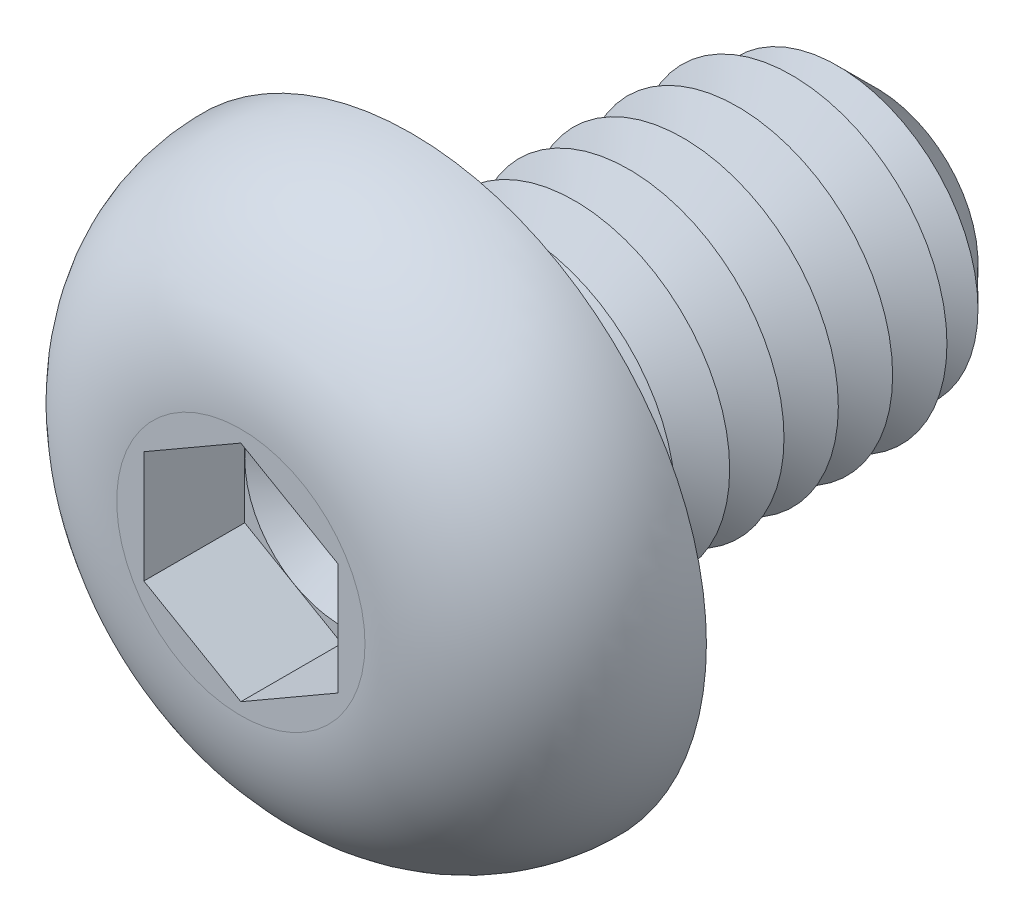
ISO-10303-21;
HEADER;
FILE_DESCRIPTION(('STEP AP214'),'2;1');
FILE_NAME('part.step','',(''),(''),'','','');
FILE_SCHEMA(('AUTOMOTIVE_DESIGN { 1 0 10303 214 1 1 1 1 }'));
ENDSEC;
DATA;
#1=APPLICATION_CONTEXT('core data for automotive mechanical design processes');
#2=APPLICATION_PROTOCOL_DEFINITION('international standard','automotive_design',2000,#1);
#3=PRODUCT_CONTEXT('',#1,'mechanical');
#4=PRODUCT('Part','Part','',(#3));
#5=PRODUCT_RELATED_PRODUCT_CATEGORY('part','',(#4));
#6=PRODUCT_DEFINITION_FORMATION('','',#4);
#7=PRODUCT_DEFINITION_CONTEXT('part definition',#1,'design');
#8=PRODUCT_DEFINITION('design','',#6,#7);
#9=PRODUCT_DEFINITION_SHAPE('','',#8);
#10=(LENGTH_UNIT() NAMED_UNIT(*) SI_UNIT(.MILLI.,.METRE.));
#11=(NAMED_UNIT(*) PLANE_ANGLE_UNIT() SI_UNIT($,.RADIAN.));
#12=(NAMED_UNIT(*) SI_UNIT($,.STERADIAN.) SOLID_ANGLE_UNIT());
#13=UNCERTAINTY_MEASURE_WITH_UNIT(LENGTH_MEASURE(1.E-05),#10,'distance_accuracy_value','');
#14=(GEOMETRIC_REPRESENTATION_CONTEXT(3) GLOBAL_UNCERTAINTY_ASSIGNED_CONTEXT((#13)) GLOBAL_UNIT_ASSIGNED_CONTEXT((#10,
#11,#12)) REPRESENTATION_CONTEXT('',''));
#15=CARTESIAN_POINT('',(0.,0.,0.));
#16=DIRECTION('',(0.,0.,1.));
#17=DIRECTION('',(1.,0.,0.));
#18=AXIS2_PLACEMENT_3D('',#15,#16,#17);
#19=CARTESIAN_POINT('',(0.,0.,0.900000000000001));
#20=DIRECTION('',(0.,0.,1.));
#21=DIRECTION('',(1.,0.,0.));
#22=AXIS2_PLACEMENT_3D('',#19,#20,#21);
#23=PLANE('',#22);
#24=CARTESIAN_POINT('',(0.,0.,0.900000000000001));
#25=DIRECTION('',(0.,0.,1.));
#26=DIRECTION('',(1.,0.,0.));
#27=AXIS2_PLACEMENT_3D('',#24,#25,#26);
#28=CIRCLE('',#27,1.25);
#29=CARTESIAN_POINT('',(1.25,0.,0.900000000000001));
#30=VERTEX_POINT('',#29);
#31=CARTESIAN_POINT('',(0.625,1.08253175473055,0.900000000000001));
#32=VERTEX_POINT('',#31);
#33=EDGE_CURVE('E117',#30,#32,#28,.T.);
#34=ORIENTED_EDGE('',*,*,#33,.F.);
#35=DIRECTION('',(0.,1.,0.));
#36=VECTOR('',#35,1.);
#37=CARTESIAN_POINT('',(1.25,-0.721687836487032,0.900000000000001));
#38=LINE('',#37,#36);
#39=CARTESIAN_POINT('',(1.25,0.721687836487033,0.900000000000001));
#40=VERTEX_POINT('',#39);
#41=EDGE_CURVE('E140',#30,#40,#38,.T.);
#42=ORIENTED_EDGE('',*,*,#41,.T.);
#43=DIRECTION('',(-0.866025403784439,0.5,0.));
#44=VECTOR('',#43,1.);
#45=CARTESIAN_POINT('',(1.25,0.721687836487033,0.900000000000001));
#46=LINE('',#45,#44);
#47=EDGE_CURVE('E135',#40,#32,#46,.T.);
#48=ORIENTED_EDGE('',*,*,#47,.T.);
#49=EDGE_LOOP('',(#34,#42,#48));
#50=FACE_BOUND('',#49,.T.);
#51=ADVANCED_FACE('F39',(#50),#23,.T.);
#52=CARTESIAN_POINT('',(0.,0.,0.900000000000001));
#53=DIRECTION('',(0.,0.,1.));
#54=DIRECTION('',(1.,0.,0.));
#55=AXIS2_PLACEMENT_3D('',#52,#53,#54);
#56=CIRCLE('',#55,1.25);
#57=CARTESIAN_POINT('',(-0.625,1.08253175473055,0.900000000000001));
#58=VERTEX_POINT('',#57);
#59=EDGE_CURVE('E11',#32,#58,#56,.T.);
#60=ORIENTED_EDGE('',*,*,#59,.F.);
#61=CARTESIAN_POINT('',(0.,1.44337567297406,0.900000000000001));
#62=VERTEX_POINT('',#61);
#63=EDGE_CURVE('E130',#32,#62,#46,.T.);
#64=ORIENTED_EDGE('',*,*,#63,.T.);
#65=DIRECTION('',(-0.866025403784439,-0.5,0.));
#66=VECTOR('',#65,1.);
#67=CARTESIAN_POINT('',(0.,1.44337567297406,0.900000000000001));
#68=LINE('',#67,#66);
#69=EDGE_CURVE('E132',#62,#58,#68,.T.);
#70=ORIENTED_EDGE('',*,*,#69,.T.);
#71=EDGE_LOOP('',(#60,#64,#70));
#72=FACE_BOUND('',#71,.T.);
#73=ADVANCED_FACE('F129',(#72),#23,.T.);
#74=CARTESIAN_POINT('',(-1.25,0.,0.900000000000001));
#75=VERTEX_POINT('',#74);
#76=EDGE_CURVE('E49',#58,#75,#56,.T.);
#77=ORIENTED_EDGE('',*,*,#76,.F.);
#78=CARTESIAN_POINT('',(-1.25,0.721687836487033,0.900000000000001));
#79=VERTEX_POINT('',#78);
#80=EDGE_CURVE('E143',#58,#79,#68,.T.);
#81=ORIENTED_EDGE('',*,*,#80,.T.);
#82=DIRECTION('',(0.,-1.,0.));
#83=VECTOR('',#82,1.);
#84=CARTESIAN_POINT('',(-1.25,0.721687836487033,0.900000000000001));
#85=LINE('',#84,#83);
#86=EDGE_CURVE('E153',#79,#75,#85,.T.);
#87=ORIENTED_EDGE('',*,*,#86,.T.);
#88=EDGE_LOOP('',(#77,#81,#87));
#89=FACE_BOUND('',#88,.T.);
#90=ADVANCED_FACE('F253',(#89),#23,.T.);
#91=CARTESIAN_POINT('',(-0.625,-1.08253175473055,0.900000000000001));
#92=VERTEX_POINT('',#91);
#93=EDGE_CURVE('E237',#75,#92,#56,.T.);
#94=ORIENTED_EDGE('',*,*,#93,.F.);
#95=CARTESIAN_POINT('',(-1.25,-0.721687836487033,0.900000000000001));
#96=VERTEX_POINT('',#95);
#97=EDGE_CURVE('E152',#75,#96,#85,.T.);
#98=ORIENTED_EDGE('',*,*,#97,.T.);
#99=DIRECTION('',(0.866025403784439,-0.5,0.));
#100=VECTOR('',#99,1.);
#101=CARTESIAN_POINT('',(-1.25,-0.721687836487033,0.900000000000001));
#102=LINE('',#101,#100);
#103=EDGE_CURVE('E158',#96,#92,#102,.T.);
#104=ORIENTED_EDGE('',*,*,#103,.T.);
#105=EDGE_LOOP('',(#94,#98,#104));
#106=FACE_BOUND('',#105,.T.);
#107=ADVANCED_FACE('F247',(#106),#23,.T.);
#108=CARTESIAN_POINT('',(0.625,-1.08253175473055,0.900000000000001));
#109=VERTEX_POINT('',#108);
#110=EDGE_CURVE('E56',#92,#109,#56,.T.);
#111=ORIENTED_EDGE('',*,*,#110,.F.);
#112=CARTESIAN_POINT('',(0.,-1.44337567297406,0.900000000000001));
#113=VERTEX_POINT('',#112);
#114=EDGE_CURVE('E157',#92,#113,#102,.T.);
#115=ORIENTED_EDGE('',*,*,#114,.T.);
#116=DIRECTION('',(0.866025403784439,0.5,0.));
#117=VECTOR('',#116,1.);
#118=CARTESIAN_POINT('',(0.,-1.44337567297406,0.900000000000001));
#119=LINE('',#118,#117);
#120=EDGE_CURVE('E163',#113,#109,#119,.T.);
#121=ORIENTED_EDGE('',*,*,#120,.T.);
#122=EDGE_LOOP('',(#111,#115,#121));
#123=FACE_BOUND('',#122,.T.);
#124=ADVANCED_FACE('F352',(#123),#23,.T.);
#125=CARTESIAN_POINT('',(0.,0.,-6.));
#126=DIRECTION('',(0.,0.,1.));
#127=DIRECTION('',(1.,0.,0.));
#128=AXIS2_PLACEMENT_3D('',#125,#126,#127);
#129=CYLINDRICAL_SURFACE('',#128,2.);
#130=CARTESIAN_POINT('',(0.,0.,-0.3));
#131=DIRECTION('',(0.,0.,1.));
#132=DIRECTION('',(1.,0.,0.));
#133=AXIS2_PLACEMENT_3D('',#130,#131,#132);
#134=CIRCLE('',#133,2.);
#135=CARTESIAN_POINT('',(2.,0.,-0.3));
#136=VERTEX_POINT('',#135);
#137=EDGE_CURVE('E220',#136,#136,#134,.F.);
#138=ORIENTED_EDGE('',*,*,#137,.T.);
#139=EDGE_LOOP('',(#138));
#140=FACE_BOUND('',#139,.T.);
#141=CARTESIAN_POINT('',(0.,0.,-0.699999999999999));
#142=DIRECTION('',(0.,0.,1.));
#143=DIRECTION('',(1.,0.,0.));
#144=AXIS2_PLACEMENT_3D('',#141,#142,#143);
#145=CIRCLE('',#144,2.);
#146=CARTESIAN_POINT('',(2.,0.,-0.699999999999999));
#147=VERTEX_POINT('',#146);
#148=EDGE_CURVE('E148',#147,#147,#145,.T.);
#149=ORIENTED_EDGE('',*,*,#148,.T.);
#150=EDGE_LOOP('',(#149));
#151=FACE_BOUND('',#150,.T.);
#152=ADVANCED_FACE('F362',(#140,#151),#129,.T.);
#153=CARTESIAN_POINT('',(0.,3.8,0.));
#154=DIRECTION('',(0.,0.,1.));
#155=DIRECTION('',(1.,0.,0.));
#156=AXIS2_PLACEMENT_3D('',#153,#154,#155);
#157=PLANE('',#156);
#158=CARTESIAN_POINT('',(0.,0.,0.));
#159=DIRECTION('',(0.,0.,1.));
#160=DIRECTION('',(1.,0.,0.));
#161=AXIS2_PLACEMENT_3D('',#158,#159,#160);
#162=CIRCLE('',#161,2.3);
#163=CARTESIAN_POINT('',(2.3,0.,0.));
#164=VERTEX_POINT('',#163);
#165=EDGE_CURVE('E229',#164,#164,#162,.T.);
#166=ORIENTED_EDGE('',*,*,#165,.T.);
#167=EDGE_LOOP('',(#166));
#168=FACE_BOUND('',#167,.T.);
#169=CARTESIAN_POINT('',(0.,0.,0.));
#170=DIRECTION('',(0.,0.,1.));
#171=DIRECTION('',(1.,0.,0.));
#172=AXIS2_PLACEMENT_3D('',#169,#170,#171);
#173=CIRCLE('',#172,3.8);
#174=CARTESIAN_POINT('',(3.8,0.,0.));
#175=VERTEX_POINT('',#174);
#176=EDGE_CURVE('E195',#175,#175,#173,.T.);
#177=ORIENTED_EDGE('',*,*,#176,.F.);
#178=EDGE_LOOP('',(#177));
#179=FACE_BOUND('',#178,.T.);
#180=ADVANCED_FACE('F367',(#168,#179),#157,.F.);
#181=CARTESIAN_POINT('',(0.,0.,2.2));
#182=DIRECTION('',(0.,0.,-1.));
#183=DIRECTION('',(-1.,0.,0.));
#184=AXIS2_PLACEMENT_3D('',#181,#182,#183);
#185=PLANE('',#184);
#186=DIRECTION('',(-0.866025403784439,-0.5,0.));
#187=VECTOR('',#186,1.);
#188=CARTESIAN_POINT('',(0.,1.44337567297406,2.2));
#189=LINE('',#188,#187);
#190=CARTESIAN_POINT('',(0.,1.44337567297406,2.2));
#191=VERTEX_POINT('',#190);
#192=CARTESIAN_POINT('',(-1.25,0.721687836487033,2.2));
#193=VERTEX_POINT('',#192);
#194=EDGE_CURVE('E173',#191,#193,#189,.T.);
#195=ORIENTED_EDGE('',*,*,#194,.F.);
#196=DIRECTION('',(-0.866025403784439,0.5,0.));
#197=VECTOR('',#196,1.);
#198=CARTESIAN_POINT('',(1.25,0.721687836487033,2.2));
#199=LINE('',#198,#197);
#200=CARTESIAN_POINT('',(1.25,0.721687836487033,2.2));
#201=VERTEX_POINT('',#200);
#202=EDGE_CURVE('E64',#201,#191,#199,.T.);
#203=ORIENTED_EDGE('',*,*,#202,.F.);
#204=DIRECTION('',(0.,1.,0.));
#205=VECTOR('',#204,1.);
#206=CARTESIAN_POINT('',(1.25,-0.721687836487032,2.2));
#207=LINE('',#206,#205);
#208=CARTESIAN_POINT('',(1.25,-0.721687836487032,2.2));
#209=VERTEX_POINT('',#208);
#210=EDGE_CURVE('E138',#209,#201,#207,.T.);
#211=ORIENTED_EDGE('',*,*,#210,.F.);
#212=DIRECTION('',(0.866025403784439,0.5,0.));
#213=VECTOR('',#212,1.);
#214=CARTESIAN_POINT('',(0.,-1.44337567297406,2.2));
#215=LINE('',#214,#213);
#216=CARTESIAN_POINT('',(0.,-1.44337567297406,2.2));
#217=VERTEX_POINT('',#216);
#218=EDGE_CURVE('E185',#217,#209,#215,.T.);
#219=ORIENTED_EDGE('',*,*,#218,.F.);
#220=DIRECTION('',(0.866025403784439,-0.5,0.));
#221=VECTOR('',#220,1.);
#222=CARTESIAN_POINT('',(-1.25,-0.721687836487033,2.2));
#223=LINE('',#222,#221);
#224=CARTESIAN_POINT('',(-1.25,-0.721687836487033,2.2));
#225=VERTEX_POINT('',#224);
#226=EDGE_CURVE('E181',#225,#217,#223,.T.);
#227=ORIENTED_EDGE('',*,*,#226,.F.);
#228=DIRECTION('',(0.,-1.,0.));
#229=VECTOR('',#228,1.);
#230=CARTESIAN_POINT('',(-1.25,0.721687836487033,2.2));
#231=LINE('',#230,#229);
#232=EDGE_CURVE('E177',#193,#225,#231,.T.);
#233=ORIENTED_EDGE('',*,*,#232,.F.);
#234=EDGE_LOOP('',(#195,#203,#211,#219,#227,#233));
#235=FACE_BOUND('',#234,.T.);
#236=CARTESIAN_POINT('',(0.,0.,2.2));
#237=DIRECTION('',(0.,0.,1.));
#238=DIRECTION('',(1.,0.,0.));
#239=AXIS2_PLACEMENT_3D('',#236,#237,#238);
#240=CIRCLE('',#239,1.6);
#241=CARTESIAN_POINT('',(1.6,0.,2.2));
#242=VERTEX_POINT('',#241);
#243=EDGE_CURVE('E212',#242,#242,#240,.T.);
#244=ORIENTED_EDGE('',*,*,#243,.T.);
#245=EDGE_LOOP('',(#244));
#246=FACE_BOUND('',#245,.T.);
#247=ADVANCED_FACE('F262',(#235,#246),#185,.F.);
#248=CARTESIAN_POINT('',(0.,0.,0.));
#249=DIRECTION('',(0.,0.,1.));
#250=DIRECTION('',(1.,0.,0.));
#251=AXIS2_PLACEMENT_3D('',#248,#249,#250);
#252=DEGENERATE_TOROIDAL_SURFACE('',#251,1.6,2.2,.T.);
#253=ORIENTED_EDGE('',*,*,#243,.F.);
#254=EDGE_LOOP('',(#253));
#255=FACE_BOUND('',#254,.T.);
#256=ORIENTED_EDGE('',*,*,#176,.T.);
#257=EDGE_LOOP('',(#256));
#258=FACE_BOUND('',#257,.T.);
#259=ADVANCED_FACE('F388',(#255,#258),#252,.T.);
#260=CARTESIAN_POINT('',(1.25,0.721687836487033,0.900000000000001));
#261=DIRECTION('',(0.5,0.866025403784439,0.));
#262=DIRECTION('',(-0.866025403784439,0.5,0.));
#263=AXIS2_PLACEMENT_3D('',#260,#261,#262);
#264=PLANE('',#263);
#265=ORIENTED_EDGE('',*,*,#202,.T.);
#266=DIRECTION('',(0.,0.,1.));
#267=VECTOR('',#266,1.);
#268=CARTESIAN_POINT('',(0.,1.44337567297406,0.900000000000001));
#269=LINE('',#268,#267);
#270=EDGE_CURVE('E136',#62,#191,#269,.T.);
#271=ORIENTED_EDGE('',*,*,#270,.F.);
#272=ORIENTED_EDGE('',*,*,#63,.F.);
#273=ORIENTED_EDGE('',*,*,#47,.F.);
#274=DIRECTION('',(0.,0.,1.));
#275=VECTOR('',#274,1.);
#276=CARTESIAN_POINT('',(1.25,0.721687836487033,0.900000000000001));
#277=LINE('',#276,#275);
#278=EDGE_CURVE('E192',#40,#201,#277,.T.);
#279=ORIENTED_EDGE('',*,*,#278,.T.);
#280=EDGE_LOOP('',(#265,#271,#272,#273,#279));
#281=FACE_BOUND('',#280,.T.);
#282=ADVANCED_FACE('F134',(#281),#264,.F.);
#283=CARTESIAN_POINT('',(1.25,-0.721687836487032,0.900000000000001));
#284=DIRECTION('',(1.,0.,0.));
#285=DIRECTION('',(0.,1.,0.));
#286=AXIS2_PLACEMENT_3D('',#283,#284,#285);
#287=PLANE('',#286);
#288=ORIENTED_EDGE('',*,*,#210,.T.);
#289=ORIENTED_EDGE('',*,*,#278,.F.);
#290=ORIENTED_EDGE('',*,*,#41,.F.);
#291=CARTESIAN_POINT('',(1.25,-0.721687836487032,0.900000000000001));
#292=VERTEX_POINT('',#291);
#293=EDGE_CURVE('E167',#292,#30,#38,.T.);
#294=ORIENTED_EDGE('',*,*,#293,.F.);
#295=DIRECTION('',(0.,0.,1.));
#296=VECTOR('',#295,1.);
#297=CARTESIAN_POINT('',(1.25,-0.721687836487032,0.900000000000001));
#298=LINE('',#297,#296);
#299=EDGE_CURVE('E196',#292,#209,#298,.T.);
#300=ORIENTED_EDGE('',*,*,#299,.T.);
#301=EDGE_LOOP('',(#288,#289,#290,#294,#300));
#302=FACE_BOUND('',#301,.T.);
#303=ADVANCED_FACE('F381',(#302),#287,.F.);
#304=CARTESIAN_POINT('',(0.,-1.44337567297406,0.900000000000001));
#305=DIRECTION('',(0.5,-0.866025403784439,0.));
#306=DIRECTION('',(0.866025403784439,0.5,0.));
#307=AXIS2_PLACEMENT_3D('',#304,#305,#306);
#308=PLANE('',#307);
#309=ORIENTED_EDGE('',*,*,#218,.T.);
#310=ORIENTED_EDGE('',*,*,#299,.F.);
#311=EDGE_CURVE('E162',#109,#292,#119,.T.);
#312=ORIENTED_EDGE('',*,*,#311,.F.);
#313=ORIENTED_EDGE('',*,*,#120,.F.);
#314=DIRECTION('',(0.,0.,1.));
#315=VECTOR('',#314,1.);
#316=CARTESIAN_POINT('',(0.,-1.44337567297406,0.900000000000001));
#317=LINE('',#316,#315);
#318=EDGE_CURVE('E198',#113,#217,#317,.T.);
#319=ORIENTED_EDGE('',*,*,#318,.T.);
#320=EDGE_LOOP('',(#309,#310,#312,#313,#319));
#321=FACE_BOUND('',#320,.T.);
#322=ADVANCED_FACE('F371',(#321),#308,.F.);
#323=CARTESIAN_POINT('',(-1.25,-0.721687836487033,0.900000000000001));
#324=DIRECTION('',(-0.5,-0.866025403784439,0.));
#325=DIRECTION('',(0.866025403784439,-0.5,0.));
#326=AXIS2_PLACEMENT_3D('',#323,#324,#325);
#327=PLANE('',#326);
#328=ORIENTED_EDGE('',*,*,#226,.T.);
#329=ORIENTED_EDGE('',*,*,#318,.F.);
#330=ORIENTED_EDGE('',*,*,#114,.F.);
#331=ORIENTED_EDGE('',*,*,#103,.F.);
#332=DIRECTION('',(0.,0.,1.));
#333=VECTOR('',#332,1.);
#334=CARTESIAN_POINT('',(-1.25,-0.721687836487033,0.900000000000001));
#335=LINE('',#334,#333);
#336=EDGE_CURVE('E201',#96,#225,#335,.T.);
#337=ORIENTED_EDGE('',*,*,#336,.T.);
#338=EDGE_LOOP('',(#328,#329,#330,#331,#337));
#339=FACE_BOUND('',#338,.T.);
#340=ADVANCED_FACE('F267',(#339),#327,.F.);
#341=CARTESIAN_POINT('',(-1.25,0.721687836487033,0.900000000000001));
#342=DIRECTION('',(-1.,0.,0.));
#343=DIRECTION('',(0.,0.,1.));
#344=AXIS2_PLACEMENT_3D('',#341,#342,#343);
#345=PLANE('',#344);
#346=ORIENTED_EDGE('',*,*,#232,.T.);
#347=ORIENTED_EDGE('',*,*,#336,.F.);
#348=ORIENTED_EDGE('',*,*,#97,.F.);
#349=ORIENTED_EDGE('',*,*,#86,.F.);
#350=DIRECTION('',(0.,0.,1.));
#351=VECTOR('',#350,1.);
#352=CARTESIAN_POINT('',(-1.25,0.721687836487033,0.900000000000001));
#353=LINE('',#352,#351);
#354=EDGE_CURVE('E204',#79,#193,#353,.T.);
#355=ORIENTED_EDGE('',*,*,#354,.T.);
#356=EDGE_LOOP('',(#346,#347,#348,#349,#355));
#357=FACE_BOUND('',#356,.T.);
#358=ADVANCED_FACE('F252',(#357),#345,.F.);
#359=CARTESIAN_POINT('',(0.,1.44337567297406,0.900000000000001));
#360=DIRECTION('',(-0.5,0.866025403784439,0.));
#361=DIRECTION('',(-0.866025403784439,-0.5,0.));
#362=AXIS2_PLACEMENT_3D('',#359,#360,#361);
#363=PLANE('',#362);
#364=ORIENTED_EDGE('',*,*,#194,.T.);
#365=ORIENTED_EDGE('',*,*,#354,.F.);
#366=ORIENTED_EDGE('',*,*,#80,.F.);
#367=ORIENTED_EDGE('',*,*,#69,.F.);
#368=ORIENTED_EDGE('',*,*,#270,.T.);
#369=EDGE_LOOP('',(#364,#365,#366,#367,#368));
#370=FACE_BOUND('',#369,.T.);
#371=ADVANCED_FACE('F256',(#370),#363,.F.);
#372=EDGE_CURVE('E43',#109,#30,#56,.T.);
#373=ORIENTED_EDGE('',*,*,#372,.F.);
#374=ORIENTED_EDGE('',*,*,#311,.T.);
#375=ORIENTED_EDGE('',*,*,#293,.T.);
#376=EDGE_LOOP('',(#373,#374,#375));
#377=FACE_BOUND('',#376,.T.);
#378=ADVANCED_FACE('F343',(#377),#23,.T.);
#379=CARTESIAN_POINT('',(0.,0.,-0.699999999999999));
#380=DIRECTION('',(0.,0.,1.));
#381=DIRECTION('',(1.,0.,0.));
#382=AXIS2_PLACEMENT_3D('',#379,#380,#381);
#383=CONICAL_SURFACE('',#382,2.,1.04719755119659);
#384=CARTESIAN_POINT('',(0.,0.,-1.05));
#385=DIRECTION('',(0.,0.,1.));
#386=DIRECTION('',(1.,0.,0.));
#387=AXIS2_PLACEMENT_3D('',#384,#385,#386);
#388=CIRCLE('',#387,1.3937822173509);
#389=CARTESIAN_POINT('',(1.3937822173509,0.,-1.05));
#390=VERTEX_POINT('',#389);
#391=EDGE_CURVE('E281',#390,#390,#388,.T.);
#392=ORIENTED_EDGE('',*,*,#391,.T.);
#393=EDGE_LOOP('',(#392));
#394=FACE_BOUND('',#393,.T.);
#395=ORIENTED_EDGE('',*,*,#148,.F.);
#396=EDGE_LOOP('',(#395));
#397=FACE_BOUND('',#396,.T.);
#398=ADVANCED_FACE('F350',(#394,#397),#383,.T.);
#399=CARTESIAN_POINT('',(0.,0.,-1.05));
#400=DIRECTION('',(0.,0.,-1.));
#401=DIRECTION('',(-1.,0.,0.));
#402=AXIS2_PLACEMENT_3D('',#399,#400,#401);
#403=CONICAL_SURFACE('',#402,1.3937822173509,1.0471975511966);
#404=CARTESIAN_POINT('',(0.,0.,-1.4));
#405=DIRECTION('',(0.,0.,1.));
#406=DIRECTION('',(1.,0.,0.));
#407=AXIS2_PLACEMENT_3D('',#404,#405,#406);
#408=CIRCLE('',#407,2.);
#409=CARTESIAN_POINT('',(2.,0.,-1.4));
#410=VERTEX_POINT('',#409);
#411=EDGE_CURVE('E279',#410,#410,#408,.T.);
#412=ORIENTED_EDGE('',*,*,#411,.T.);
#413=EDGE_LOOP('',(#412));
#414=FACE_BOUND('',#413,.T.);
#415=ORIENTED_EDGE('',*,*,#391,.F.);
#416=EDGE_LOOP('',(#415));
#417=FACE_BOUND('',#416,.T.);
#418=ADVANCED_FACE('F357',(#414,#417),#403,.T.);
#419=CARTESIAN_POINT('',(0.,0.,-1.4));
#420=DIRECTION('',(0.,0.,1.));
#421=DIRECTION('',(1.,0.,0.));
#422=AXIS2_PLACEMENT_3D('',#419,#420,#421);
#423=CONICAL_SURFACE('',#422,2.,1.04719755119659);
#424=CARTESIAN_POINT('',(0.,0.,-1.75));
#425=DIRECTION('',(0.,0.,1.));
#426=DIRECTION('',(1.,0.,0.));
#427=AXIS2_PLACEMENT_3D('',#424,#425,#426);
#428=CIRCLE('',#427,1.3937822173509);
#429=CARTESIAN_POINT('',(1.3937822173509,0.,-1.75));
#430=VERTEX_POINT('',#429);
#431=EDGE_CURVE('E282',#430,#430,#428,.T.);
#432=ORIENTED_EDGE('',*,*,#431,.T.);
#433=EDGE_LOOP('',(#432));
#434=FACE_BOUND('',#433,.T.);
#435=ORIENTED_EDGE('',*,*,#411,.F.);
#436=EDGE_LOOP('',(#435));
#437=FACE_BOUND('',#436,.T.);
#438=ADVANCED_FACE('F618',(#434,#437),#423,.T.);
#439=CARTESIAN_POINT('',(0.,0.,-1.75));
#440=DIRECTION('',(0.,0.,-1.));
#441=DIRECTION('',(-1.,0.,0.));
#442=AXIS2_PLACEMENT_3D('',#439,#440,#441);
#443=CONICAL_SURFACE('',#442,1.3937822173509,1.0471975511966);
#444=CARTESIAN_POINT('',(0.,0.,-2.1));
#445=DIRECTION('',(0.,0.,1.));
#446=DIRECTION('',(1.,0.,0.));
#447=AXIS2_PLACEMENT_3D('',#444,#445,#446);
#448=CIRCLE('',#447,2.);
#449=CARTESIAN_POINT('',(2.,0.,-2.1));
#450=VERTEX_POINT('',#449);
#451=EDGE_CURVE('E290',#450,#450,#448,.T.);
#452=ORIENTED_EDGE('',*,*,#451,.T.);
#453=EDGE_LOOP('',(#452));
#454=FACE_BOUND('',#453,.T.);
#455=ORIENTED_EDGE('',*,*,#431,.F.);
#456=EDGE_LOOP('',(#455));
#457=FACE_BOUND('',#456,.T.);
#458=ADVANCED_FACE('F608',(#454,#457),#443,.T.);
#459=CARTESIAN_POINT('',(0.,0.,-2.1));
#460=DIRECTION('',(0.,0.,1.));
#461=DIRECTION('',(1.,0.,0.));
#462=AXIS2_PLACEMENT_3D('',#459,#460,#461);
#463=CONICAL_SURFACE('',#462,2.,1.04719755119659);
#464=CARTESIAN_POINT('',(0.,0.,-2.45));
#465=DIRECTION('',(0.,0.,1.));
#466=DIRECTION('',(1.,0.,0.));
#467=AXIS2_PLACEMENT_3D('',#464,#465,#466);
#468=CIRCLE('',#467,1.3937822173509);
#469=CARTESIAN_POINT('',(1.3937822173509,0.,-2.45));
#470=VERTEX_POINT('',#469);
#471=EDGE_CURVE('E296',#470,#470,#468,.T.);
#472=ORIENTED_EDGE('',*,*,#471,.T.);
#473=EDGE_LOOP('',(#472));
#474=FACE_BOUND('',#473,.T.);
#475=ORIENTED_EDGE('',*,*,#451,.F.);
#476=EDGE_LOOP('',(#475));
#477=FACE_BOUND('',#476,.T.);
#478=ADVANCED_FACE('F598',(#474,#477),#463,.T.);
#479=CARTESIAN_POINT('',(0.,0.,-2.45));
#480=DIRECTION('',(0.,0.,-1.));
#481=DIRECTION('',(-1.,0.,0.));
#482=AXIS2_PLACEMENT_3D('',#479,#480,#481);
#483=CONICAL_SURFACE('',#482,1.3937822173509,1.0471975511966);
#484=CARTESIAN_POINT('',(0.,0.,-2.8));
#485=DIRECTION('',(0.,0.,1.));
#486=DIRECTION('',(1.,0.,0.));
#487=AXIS2_PLACEMENT_3D('',#484,#485,#486);
#488=CIRCLE('',#487,2.);
#489=CARTESIAN_POINT('',(2.,0.,-2.8));
#490=VERTEX_POINT('',#489);
#491=EDGE_CURVE('E275',#490,#490,#488,.T.);
#492=ORIENTED_EDGE('',*,*,#491,.T.);
#493=EDGE_LOOP('',(#492));
#494=FACE_BOUND('',#493,.T.);
#495=ORIENTED_EDGE('',*,*,#471,.F.);
#496=EDGE_LOOP('',(#495));
#497=FACE_BOUND('',#496,.T.);
#498=ADVANCED_FACE('F588',(#494,#497),#483,.T.);
#499=CARTESIAN_POINT('',(0.,0.,-2.8));
#500=DIRECTION('',(0.,0.,1.));
#501=DIRECTION('',(1.,0.,0.));
#502=AXIS2_PLACEMENT_3D('',#499,#500,#501);
#503=CONICAL_SURFACE('',#502,2.,1.04719755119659);
#504=CARTESIAN_POINT('',(0.,0.,-3.15));
#505=DIRECTION('',(0.,0.,1.));
#506=DIRECTION('',(1.,0.,0.));
#507=AXIS2_PLACEMENT_3D('',#504,#505,#506);
#508=CIRCLE('',#507,1.3937822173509);
#509=CARTESIAN_POINT('',(1.3937822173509,0.,-3.15));
#510=VERTEX_POINT('',#509);
#511=EDGE_CURVE('E273',#510,#510,#508,.T.);
#512=ORIENTED_EDGE('',*,*,#511,.T.);
#513=EDGE_LOOP('',(#512));
#514=FACE_BOUND('',#513,.T.);
#515=ORIENTED_EDGE('',*,*,#491,.F.);
#516=EDGE_LOOP('',(#515));
#517=FACE_BOUND('',#516,.T.);
#518=ADVANCED_FACE('F578',(#514,#517),#503,.T.);
#519=CARTESIAN_POINT('',(0.,0.,-3.15));
#520=DIRECTION('',(0.,0.,-1.));
#521=DIRECTION('',(-1.,0.,0.));
#522=AXIS2_PLACEMENT_3D('',#519,#520,#521);
#523=CONICAL_SURFACE('',#522,1.3937822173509,1.0471975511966);
#524=CARTESIAN_POINT('',(0.,0.,-3.5));
#525=DIRECTION('',(0.,0.,1.));
#526=DIRECTION('',(1.,0.,0.));
#527=AXIS2_PLACEMENT_3D('',#524,#525,#526);
#528=CIRCLE('',#527,2.);
#529=CARTESIAN_POINT('',(2.,0.,-3.5));
#530=VERTEX_POINT('',#529);
#531=EDGE_CURVE('E276',#530,#530,#528,.T.);
#532=ORIENTED_EDGE('',*,*,#531,.T.);
#533=EDGE_LOOP('',(#532));
#534=FACE_BOUND('',#533,.T.);
#535=ORIENTED_EDGE('',*,*,#511,.F.);
#536=EDGE_LOOP('',(#535));
#537=FACE_BOUND('',#536,.T.);
#538=ADVANCED_FACE('F568',(#534,#537),#523,.T.);
#539=CARTESIAN_POINT('',(0.,0.,-3.5));
#540=DIRECTION('',(0.,0.,1.));
#541=DIRECTION('',(1.,0.,0.));
#542=AXIS2_PLACEMENT_3D('',#539,#540,#541);
#543=CONICAL_SURFACE('',#542,2.,1.04719755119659);
#544=CARTESIAN_POINT('',(0.,0.,-3.85));
#545=DIRECTION('',(0.,0.,1.));
#546=DIRECTION('',(1.,0.,0.));
#547=AXIS2_PLACEMENT_3D('',#544,#545,#546);
#548=CIRCLE('',#547,1.3937822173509);
#549=CARTESIAN_POINT('',(1.3937822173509,0.,-3.85));
#550=VERTEX_POINT('',#549);
#551=EDGE_CURVE('E306',#550,#550,#548,.T.);
#552=ORIENTED_EDGE('',*,*,#551,.T.);
#553=EDGE_LOOP('',(#552));
#554=FACE_BOUND('',#553,.T.);
#555=ORIENTED_EDGE('',*,*,#531,.F.);
#556=EDGE_LOOP('',(#555));
#557=FACE_BOUND('',#556,.T.);
#558=ADVANCED_FACE('F558',(#554,#557),#543,.T.);
#559=CARTESIAN_POINT('',(0.,0.,-3.85));
#560=DIRECTION('',(0.,0.,-1.));
#561=DIRECTION('',(-1.,0.,0.));
#562=AXIS2_PLACEMENT_3D('',#559,#560,#561);
#563=CONICAL_SURFACE('',#562,1.3937822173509,1.0471975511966);
#564=CARTESIAN_POINT('',(0.,0.,-4.2));
#565=DIRECTION('',(0.,0.,1.));
#566=DIRECTION('',(1.,0.,0.));
#567=AXIS2_PLACEMENT_3D('',#564,#565,#566);
#568=CIRCLE('',#567,2.);
#569=CARTESIAN_POINT('',(2.,0.,-4.2));
#570=VERTEX_POINT('',#569);
#571=EDGE_CURVE('E309',#570,#570,#568,.T.);
#572=ORIENTED_EDGE('',*,*,#571,.T.);
#573=EDGE_LOOP('',(#572));
#574=FACE_BOUND('',#573,.T.);
#575=ORIENTED_EDGE('',*,*,#551,.F.);
#576=EDGE_LOOP('',(#575));
#577=FACE_BOUND('',#576,.T.);
#578=ADVANCED_FACE('F548',(#574,#577),#563,.T.);
#579=CARTESIAN_POINT('',(0.,0.,-4.2));
#580=DIRECTION('',(0.,0.,1.));
#581=DIRECTION('',(1.,0.,0.));
#582=AXIS2_PLACEMENT_3D('',#579,#580,#581);
#583=CONICAL_SURFACE('',#582,2.,1.04719755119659);
#584=CARTESIAN_POINT('',(0.,0.,-4.55));
#585=DIRECTION('',(0.,0.,1.));
#586=DIRECTION('',(1.,0.,0.));
#587=AXIS2_PLACEMENT_3D('',#584,#585,#586);
#588=CIRCLE('',#587,1.3937822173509);
#589=CARTESIAN_POINT('',(1.3937822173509,0.,-4.55));
#590=VERTEX_POINT('',#589);
#591=EDGE_CURVE('E225',#590,#590,#588,.T.);
#592=ORIENTED_EDGE('',*,*,#591,.T.);
#593=EDGE_LOOP('',(#592));
#594=FACE_BOUND('',#593,.T.);
#595=ORIENTED_EDGE('',*,*,#571,.F.);
#596=EDGE_LOOP('',(#595));
#597=FACE_BOUND('',#596,.T.);
#598=ADVANCED_FACE('F538',(#594,#597),#583,.T.);
#599=CARTESIAN_POINT('',(0.,0.,-4.55));
#600=DIRECTION('',(0.,0.,-1.));
#601=DIRECTION('',(-1.,0.,0.));
#602=AXIS2_PLACEMENT_3D('',#599,#600,#601);
#603=CONICAL_SURFACE('',#602,1.3937822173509,1.0471975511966);
#604=CARTESIAN_POINT('',(0.,0.,-4.9));
#605=DIRECTION('',(0.,0.,1.));
#606=DIRECTION('',(1.,0.,0.));
#607=AXIS2_PLACEMENT_3D('',#604,#605,#606);
#608=CIRCLE('',#607,2.);
#609=CARTESIAN_POINT('',(2.,0.,-4.9));
#610=VERTEX_POINT('',#609);
#611=EDGE_CURVE('E226',#610,#610,#608,.T.);
#612=ORIENTED_EDGE('',*,*,#611,.T.);
#613=EDGE_LOOP('',(#612));
#614=FACE_BOUND('',#613,.T.);
#615=ORIENTED_EDGE('',*,*,#591,.F.);
#616=EDGE_LOOP('',(#615));
#617=FACE_BOUND('',#616,.T.);
#618=ADVANCED_FACE('F338',(#614,#617),#603,.T.);
#619=CARTESIAN_POINT('',(0.,0.,-4.9));
#620=DIRECTION('',(0.,0.,1.));
#621=DIRECTION('',(1.,0.,0.));
#622=AXIS2_PLACEMENT_3D('',#619,#620,#621);
#623=CONICAL_SURFACE('',#622,2.,1.04719755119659);
#624=CARTESIAN_POINT('',(0.,0.,-5.25));
#625=DIRECTION('',(0.,0.,1.));
#626=DIRECTION('',(1.,0.,0.));
#627=AXIS2_PLACEMENT_3D('',#624,#625,#626);
#628=CIRCLE('',#627,1.3937822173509);
#629=CARTESIAN_POINT('',(1.3937822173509,0.,-5.25));
#630=VERTEX_POINT('',#629);
#631=EDGE_CURVE('E124',#630,#630,#628,.T.);
#632=ORIENTED_EDGE('',*,*,#631,.T.);
#633=EDGE_LOOP('',(#632));
#634=FACE_BOUND('',#633,.T.);
#635=ORIENTED_EDGE('',*,*,#611,.F.);
#636=EDGE_LOOP('',(#635));
#637=FACE_BOUND('',#636,.T.);
#638=ADVANCED_FACE('F323',(#634,#637),#623,.T.);
#639=CARTESIAN_POINT('',(0.,0.,-5.25));
#640=DIRECTION('',(0.,0.,-1.));
#641=DIRECTION('',(-1.,0.,0.));
#642=AXIS2_PLACEMENT_3D('',#639,#640,#641);
#643=CONICAL_SURFACE('',#642,1.3937822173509,1.0471975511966);
#644=CARTESIAN_POINT('',(0.,0.,-5.49019237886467));
#645=DIRECTION('',(0.,0.,-1.));
#646=DIRECTION('',(-1.,0.,0.));
#647=AXIS2_PLACEMENT_3D('',#644,#645,#646);
#648=CIRCLE('',#647,1.80980762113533);
#649=CARTESIAN_POINT('',(-1.80980762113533,0.,-5.49019237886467));
#650=VERTEX_POINT('',#649);
#651=EDGE_CURVE('E221',#650,#650,#648,.T.);
#652=ORIENTED_EDGE('',*,*,#651,.F.);
#653=EDGE_LOOP('',(#652));
#654=FACE_BOUND('',#653,.T.);
#655=ORIENTED_EDGE('',*,*,#631,.F.);
#656=EDGE_LOOP('',(#655));
#657=FACE_BOUND('',#656,.T.);
#658=ADVANCED_FACE('F326',(#654,#657),#643,.T.);
#659=CARTESIAN_POINT('',(0.,0.,-6.));
#660=DIRECTION('',(0.,0.,-1.));
#661=DIRECTION('',(-1.,0.,0.));
#662=AXIS2_PLACEMENT_3D('',#659,#660,#661);
#663=PLANE('',#662);
#664=CARTESIAN_POINT('',(0.,0.,-6.));
#665=DIRECTION('',(0.,0.,-1.));
#666=DIRECTION('',(-1.,0.,0.));
#667=AXIS2_PLACEMENT_3D('',#664,#665,#666);
#668=CIRCLE('',#667,1.3);
#669=CARTESIAN_POINT('',(-1.3,0.,-6.));
#670=VERTEX_POINT('',#669);
#671=EDGE_CURVE('E216',#670,#670,#668,.T.);
#672=ORIENTED_EDGE('',*,*,#671,.T.);
#673=EDGE_LOOP('',(#672));
#674=FACE_BOUND('',#673,.T.);
#675=ADVANCED_FACE('F328',(#674),#663,.T.);
#676=CARTESIAN_POINT('',(0.,0.,-6.));
#677=DIRECTION('',(0.,0.,1.));
#678=DIRECTION('',(1.,0.,0.));
#679=AXIS2_PLACEMENT_3D('',#676,#677,#678);
#680=CONICAL_SURFACE('',#679,1.3,0.785398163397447);
#681=ORIENTED_EDGE('',*,*,#671,.F.);
#682=EDGE_LOOP('',(#681));
#683=FACE_BOUND('',#682,.T.);
#684=ORIENTED_EDGE('',*,*,#651,.T.);
#685=EDGE_LOOP('',(#684));
#686=FACE_BOUND('',#685,.T.);
#687=ADVANCED_FACE('F335',(#683,#686),#680,.T.);
#688=CARTESIAN_POINT('',(0.,0.,-0.3));
#689=DIRECTION('',(0.,0.,1.));
#690=DIRECTION('',(1.,0.,0.));
#691=AXIS2_PLACEMENT_3D('',#688,#689,#690);
#692=TOROIDAL_SURFACE('',#691,2.3,0.3);
#693=ORIENTED_EDGE('',*,*,#165,.F.);
#694=EDGE_LOOP('',(#693));
#695=FACE_BOUND('',#694,.T.);
#696=ORIENTED_EDGE('',*,*,#137,.F.);
#697=EDGE_LOOP('',(#696));
#698=FACE_BOUND('',#697,.T.);
#699=ADVANCED_FACE('F41',(#695,#698),#692,.F.);
#700=CARTESIAN_POINT('',(0.,0.,0.900000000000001));
#701=DIRECTION('',(0.,0.,1.));
#702=DIRECTION('',(1.,0.,0.));
#703=AXIS2_PLACEMENT_3D('',#700,#701,#702);
#704=CONICAL_SURFACE('',#703,1.25,1.0471975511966);
#705=CARTESIAN_POINT('',(0.,0.,0.178312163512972));
#706=VERTEX_POINT('',#705);
#707=VERTEX_LOOP('',#706);
#708=FACE_BOUND('',#707,.T.);
#709=ORIENTED_EDGE('',*,*,#33,.T.);
#710=ORIENTED_EDGE('',*,*,#59,.T.);
#711=ORIENTED_EDGE('',*,*,#76,.T.);
#712=ORIENTED_EDGE('',*,*,#93,.T.);
#713=ORIENTED_EDGE('',*,*,#110,.T.);
#714=ORIENTED_EDGE('',*,*,#372,.T.);
#715=EDGE_LOOP('',(#709,#710,#711,#712,#713,#714));
#716=FACE_BOUND('',#715,.T.);
#717=ADVANCED_FACE('F113',(#708,#716),#704,.F.);
#718=CLOSED_SHELL('',(#51,#73,#90,#107,#124,#152,#180,#247,#259,#282,#303,#322,#340,#358,#371,
#378,#398,#418,#438,#458,#478,#498,#518,#538,#558,#578,#598,#618,#638,#658,#675,#687,#699,#717));
#719=MANIFOLD_SOLID_BREP('B2',#718);
#720=ADVANCED_BREP_SHAPE_REPRESENTATION('',(#18,#719),#14);
#721=SHAPE_DEFINITION_REPRESENTATION(#9,#720);
ENDSEC;
END-ISO-10303-21;
